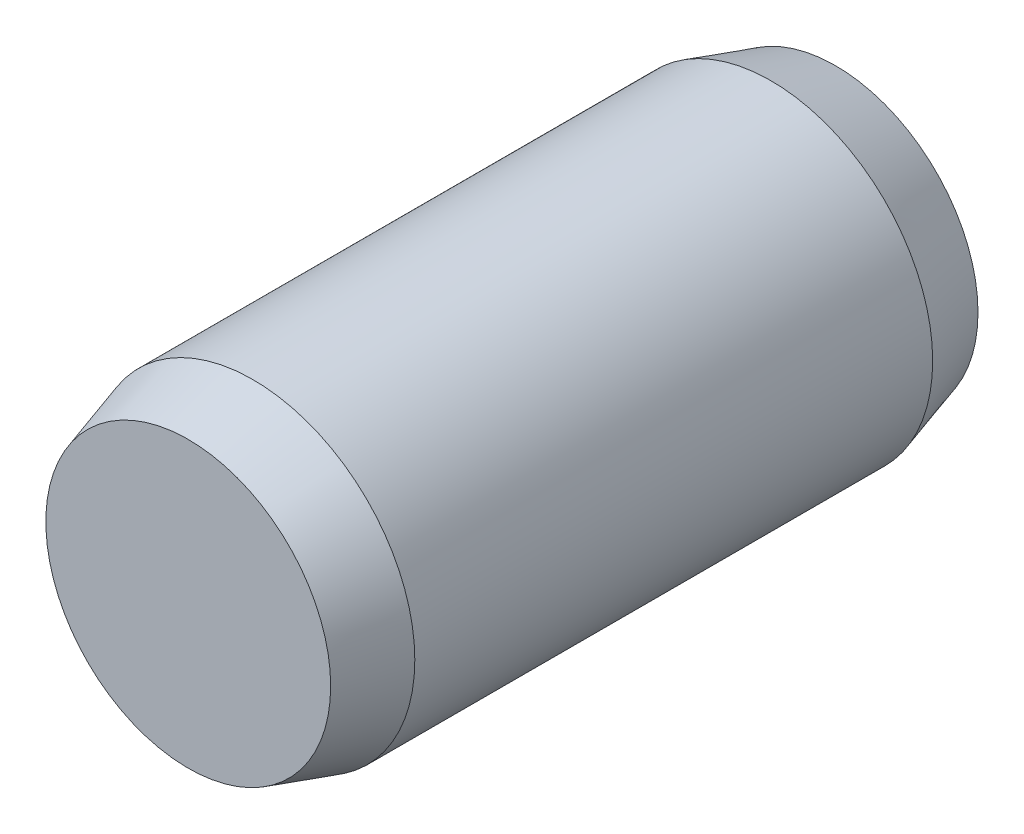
from build123d import *

# Parameters (mm, degrees)
SCHIZZO1_R                   = 2.5
ESTRUSIONE_ESTRUSIONE1_DEPTH = 10
SMUSSO1_SIZE                 = 1
SMUSSO1_SIZE2                = 0.3
SMUSSO2_SIZE                 = 0.3
SMUSSO2_SIZE2                = 1


with BuildPart() as part:
    # Schizzo1 → Estrusione-Estrusione1 (new body)
    with BuildSketch(Plane.XY):
        Circle(SCHIZZO1_R)
    extrude(amount=ESTRUSIONE_ESTRUSIONE1_DEPTH)

    # Smusso1
    smusso1_edges = [part.edges().sort_by_distance(p)[0] for p in [
        (-2.5, 0, 10),
    ]]
    smusso1_side = [part.faces().sort_by_distance(p)[0] for p in [
        (-2.5, 0, 5),
    ]]
    chamfer(smusso1_edges, length=SMUSSO1_SIZE, length2=SMUSSO1_SIZE2, reference=smusso1_side[0])

    # Smusso2
    smusso2_edges = [part.edges().sort_by_distance(p)[0] for p in [
        (-2.5, 0, 0),
    ]]
    smusso2_side = [part.faces().sort_by_distance(p)[0] for p in [
        (0, 0, 0),
    ]]
    chamfer(smusso2_edges, length=SMUSSO2_SIZE, length2=SMUSSO2_SIZE2, reference=smusso2_side[0])


solid = part.part
